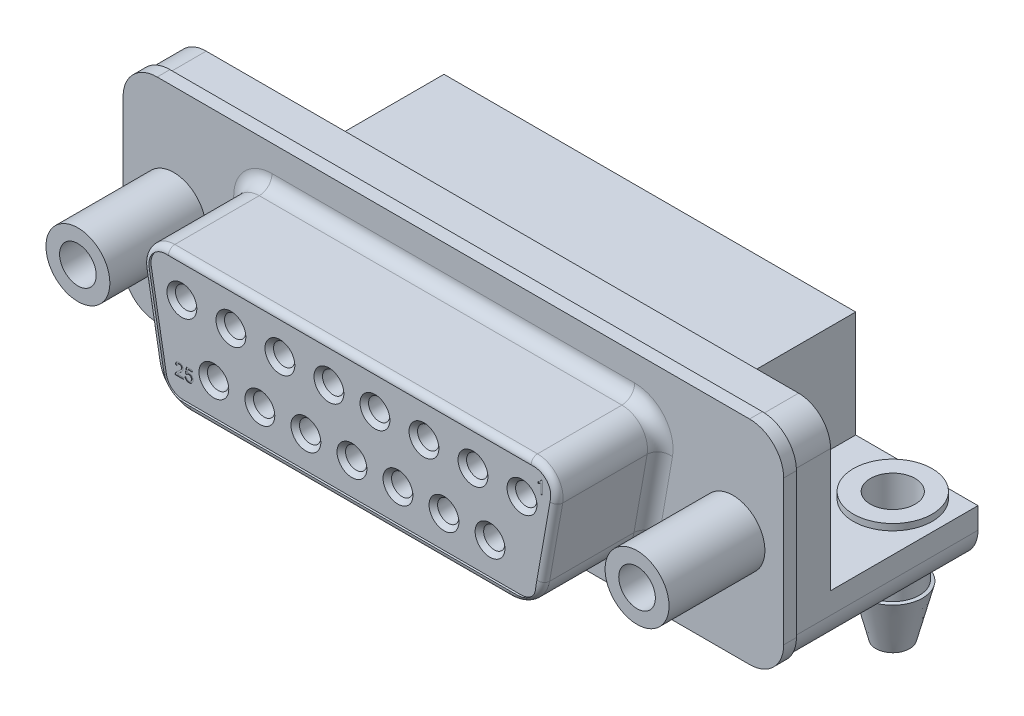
from build123d import *

# Parameters (mm, degrees)
SKETCH1_R               = 1.0922
BASE_EXTRUDE_DEPTH      = 0.762
PIN_BOSS_DEPTH          = 6.1722
FILLET1_R               = 0.762
FILLET2_R               = 0.381
PIN_FACE_RELEIF_DEPTH   = 0.127
BACKSIDE_BOSS_DEPTH     = 2.159
BACKSIDE_2_DEPTH        = 8.7884
SKETCH10_R              = 0.635
BOTT_ROW_HOLES_DEPTH    = 6.35
SKETCH11_R              = 0.635
TOP_ROW_HOLES_DEPTH     = 6.35
CHAMFER2_SIZE           = 0.254
SKETCH13_W              = 0.635
SKETCH13_H              = 0.635
PINS_PINS_PINS_DEPTH    = 4.2418
SKETCH15_R              = 1.905
SKETCH15_R_2            = 1.0922
THREADEDSTANDOFFS_DEPTH = 5.715
SKETCH16_R              = 1.5875
MOUNT_HOLES_DEPTH       = 25.396524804
F_1_PIN_DEPTH           = 0.0254
F_15PIN_DEPTH           = 0.0254


with BuildPart() as part:
    # Sketch1 → Base-Extrude (new body)
    with BuildSketch(Plane.XY):
        with BuildLine():
            Line((-17.653, -6.3373), (17.653, -6.3373))
            ThreePointArc((17.653, -6.3373), (19.089840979, -5.742140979), (19.685, -4.3053))
            Line((19.685, -4.3053), (19.685, 4.3053))
            ThreePointArc((19.685, 4.3053), (19.089840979, 5.742140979), (17.653, 6.3373))
            Line((17.653, 6.3373), (-17.653, 6.3373))
            ThreePointArc((-17.653, 6.3373), (-19.089840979, 5.742140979), (-19.685, 4.3053))
            Line((-19.685, 4.3053), (-19.685, -4.3053))
            ThreePointArc((-19.685, -4.3053), (-19.089840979, -5.742140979), (-17.653, -6.3373))
        make_face()
        with Locations(Location((16.6624, 0, 0), (0, 0, 180))):
            Circle(SKETCH1_R, mode=Mode.SUBTRACT)
        with Locations(Location((-16.6624, 0, 0), (0, 0, 180))):
            Circle(SKETCH1_R, mode=Mode.SUBTRACT)
    extrude(amount=BASE_EXTRUDE_DEPTH)

    # Sketch2 → Pin Boss (add)
    with BuildSketch(Plane.XY.offset(0.762)):
        with BuildLine():
            Line((-10.8077, 4.0132), (10.8077, 4.0132))
            ThreePointArc((10.8077, 4.0132), (11.975151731, 3.468808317), (12.308547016, 2.224560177))
            Line((12.308547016, 2.224560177), (11.527134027, -2.207053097))
            ThreePointArc((11.527134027, -2.207053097), (10.832149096, -3.410802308), (9.526004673, -3.8862))
            Line((9.526004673, -3.8862), (-9.526004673, -3.8862))
            ThreePointArc((-9.526004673, -3.8862), (-10.832149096, -3.410802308), (-11.527134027, -2.207053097))
            Line((-11.527134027, -2.207053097), (-12.308547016, 2.224560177))
            ThreePointArc((-12.308547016, 2.224560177), (-11.975151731, 3.468808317), (-10.8077, 4.0132))
        make_face()
    extrude(amount=PIN_BOSS_DEPTH)

    # Fillet1
    fillet1_edges = [part.edges().sort_by_distance(p)[0] for p in [
        (11.975151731, 3.468808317, 0.762),
        (0, 4.0132, 0.762),
        (-11.975151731, 3.468808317, 0.762),
        (-11.917840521, 0.00875354, 0.762),
        (-10.832149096, -3.410802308, 0.762),
        (0, -3.8862, 0.762),
        (10.832149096, -3.410802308, 0.762),
        (11.917840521, 0.00875354, 0.762),
    ]]
    fillet(fillet1_edges, radius=FILLET1_R)

    # Fillet2
    fillet2_edges = [part.edges().sort_by_distance(p)[0] for p in [
        (11.975151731, 3.468808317, 6.9342),
        (0, 4.0132, 6.9342),
        (-11.975151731, 3.468808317, 6.9342),
        (-11.917840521, 0.00875354, 6.9342),
        (-10.832149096, -3.410802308, 6.9342),
        (0, -3.8862, 6.9342),
        (10.832149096, -3.410802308, 6.9342),
        (11.917840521, 0.00875354, 6.9342),
    ]]
    fillet(fillet2_edges, radius=FILLET2_R)

    # Sketch3 → Pin Face Releif (cut)
    with BuildSketch(Plane.XY.offset(6.9342)):
        with BuildLine():
            Line((-10.959052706, 3.6322), (10.959052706, 3.6322))
            ThreePointArc((10.959052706, 3.6322), (11.73735386, 3.269272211), (11.959617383, 2.439773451))
            Line((11.959617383, 2.439773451), (11.059397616, -2.665626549))
            ThreePointArc((11.059397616, -2.665626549), (10.71190515, -3.267501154), (10.058832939, -3.5052))
            Line((10.058832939, -3.5052), (-10.058832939, -3.5052))
            ThreePointArc((-10.058832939, -3.5052), (-10.71190515, -3.267501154), (-11.059397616, -2.665626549))
            Line((-11.059397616, -2.665626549), (-11.959617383, 2.439773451))
            ThreePointArc((-11.959617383, 2.439773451), (-11.73735386, 3.269272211), (-10.959052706, 3.6322))
        make_face()
    extrude(amount=-PIN_FACE_RELEIF_DEPTH, mode=Mode.SUBTRACT)

    # Sketch5 → BACKSIDE BOSS (add)
    with BuildSketch(Plane(origin=(0, 0, 0), x_dir=(-1, 0, 0), z_dir=(0, 0, -1))):
        with BuildLine():
            Line((19.558, -4.3053), (19.558, 4.3053))
            ThreePointArc((19.558, 4.3053), (19.000038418, 5.652338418), (17.653, 6.2103))
            Line((17.653, 6.2103), (-17.653, 6.2103))
            ThreePointArc((-17.653, 6.2103), (-19.000038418, 5.652338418), (-19.558, 4.3053))
            Line((-19.558, 4.3053), (-19.558, -4.3053))
            ThreePointArc((-19.558, -4.3053), (-19.000038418, -5.652338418), (-17.653, -6.2103))
            Line((-17.653, -6.2103), (17.653, -6.2103))
            ThreePointArc((17.653, -6.2103), (19.000038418, -5.652338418), (19.558, -4.3053))
        make_face()
    extrude(amount=BACKSIDE_BOSS_DEPTH)

    # Sketch7 → backside_2 (add)
    with BuildSketch(Plane(origin=(0, 0, -2.159), x_dir=(-1, 0, 0), z_dir=(0, 0, -1))):
        with BuildLine():
            Line((17.653, -6.2103), (-17.653, -6.2103))
            ThreePointArc((-17.653, -6.2103), (-19.000038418, -5.652338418), (-19.558, -4.3053))
            Line((-19.558, -4.3053), (-19.558, -3.0353))
            Line((-19.558, -3.0353), (-12.2682, -3.0353))
            Line((-12.2682, -3.0353), (-12.2682, 3.3147))
            Line((-12.2682, 3.3147), (12.2682, 3.3147))
            Line((12.2682, 3.3147), (12.2682, -3.0353))
            Line((12.2682, -3.0353), (19.558, -3.0353))
            Line((19.558, -3.0353), (19.558, -4.3053))
            ThreePointArc((19.558, -4.3053), (19.000038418, -5.652338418), (17.653, -6.2103))
        make_face()
    extrude(amount=BACKSIDE_2_DEPTH)

    # Sketch10 → bott ROW HOLES (cut)
    with BuildSketch(Plane.XY.offset(6.8072)):
        with Locations((0, -1.6002)):
            Circle(SKETCH10_R)
        with Locations((2.7432, -1.6002)):
            Circle(SKETCH10_R)
        with Locations((5.4864, -1.6002)):
            Circle(SKETCH10_R)
        with Locations((8.2296, -1.6002)):
            Circle(SKETCH10_R)
        with Locations(Location((-8.2296, -1.6002, 0), (0, 0, 180))):
            Circle(SKETCH10_R)
        with Locations(Location((-5.4864, -1.6002, 0), (0, 0, 180))):
            Circle(SKETCH10_R)
        with Locations(Location((-2.7432, -1.6002, 0), (0, 0, 180))):
            Circle(SKETCH10_R)
    extrude(amount=-BOTT_ROW_HOLES_DEPTH, mode=Mode.SUBTRACT)

    # Sketch11 → top ROW HOLES (cut)
    with BuildSketch(Plane.XY.offset(6.8072)):
        with Locations((-4.2926, 1.6002)):
            Circle(SKETCH11_R)
        with Locations((-7.2136, 1.6002)):
            Circle(SKETCH11_R)
        with Locations((-10.1346, 1.6002)):
            Circle(SKETCH11_R)
        with Locations(Location((1.3716, 1.6002, 0), (0, 0, 180))):
            Circle(SKETCH11_R)
        with Locations((-1.3716, 1.6002)):
            Circle(SKETCH11_R)
        with Locations(Location((10.1346, 1.6002, 0), (0, 0, 180))):
            Circle(SKETCH11_R)
        with Locations(Location((7.2136, 1.6002, 0), (0, 0, 180))):
            Circle(SKETCH11_R)
        with Locations(Location((4.2926, 1.6002, 0), (0, 0, 180))):
            Circle(SKETCH11_R)
    extrude(amount=-TOP_ROW_HOLES_DEPTH, mode=Mode.SUBTRACT)

    # Chamfer2
    chamfer2_edges = [part.edges().sort_by_distance(p)[0] for p in [
        (-0.635, -1.6002, 6.8072),
        (2.1082, -1.6002, 6.8072),
        (4.8514, -1.6002, 6.8072),
        (7.5946, -1.6002, 6.8072),
        (-7.5946, -1.6002, 6.8072),
        (-4.8514, -1.6002, 6.8072),
        (-2.1082, -1.6002, 6.8072),
        (-4.9276, 1.6002, 6.8072),
        (-7.8486, 1.6002, 6.8072),
        (-10.7696, 1.6002, 6.8072),
        (2.0066, 1.6002, 6.8072),
        (-2.0066, 1.6002, 6.8072),
        (10.7696, 1.6002, 6.8072),
        (7.8486, 1.6002, 6.8072),
        (4.9276, 1.6002, 6.8072),
    ]]
    chamfer(chamfer2_edges, length=CHAMFER2_SIZE)

    # Sketch13 → pins pins pins (add)
    with BuildSketch(Plane.XZ.offset(6.2103)):
        with Locations((-8.132710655, -8.665222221)):
            Rectangle(SKETCH13_W, SKETCH13_H)
        with Locations((-5.414910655, -8.665222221)):
            Rectangle(SKETCH13_W, SKETCH13_H)
        with Locations((-2.697110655, -8.665222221)):
            Rectangle(SKETCH13_W, SKETCH13_H)
        with Locations((0.020689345, -8.665222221)):
            Rectangle(SKETCH13_W, SKETCH13_H)
        with Locations((2.738489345, -8.665222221)):
            Rectangle(SKETCH13_W, SKETCH13_H)
        with Locations((5.456289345, -8.665222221)):
            Rectangle(SKETCH13_W, SKETCH13_H)
        with Locations((8.174089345, -8.665222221)):
            Rectangle(SKETCH13_W, SKETCH13_H)
        with Locations((-9.490929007, -10.324150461)):
            Rectangle(SKETCH13_W, SKETCH13_H)
        with Locations((-6.773129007, -10.324150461)):
            Rectangle(SKETCH13_W, SKETCH13_H)
        with Locations((-4.055329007, -10.324150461)):
            Rectangle(SKETCH13_W, SKETCH13_H)
        with Locations((-1.337529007, -10.324150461)):
            Rectangle(SKETCH13_W, SKETCH13_H)
        with Locations((1.380270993, -10.324150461)):
            Rectangle(SKETCH13_W, SKETCH13_H)
        with Locations((4.098070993, -10.324150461)):
            Rectangle(SKETCH13_W, SKETCH13_H)
        with Locations((6.815870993, -10.324150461)):
            Rectangle(SKETCH13_W, SKETCH13_H)
        with Locations((9.533670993, -10.324150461)):
            Rectangle(SKETCH13_W, SKETCH13_H)
    extrude(amount=PINS_PINS_PINS_DEPTH)

    # Sketch15 → Threadedstandoffs (add)
    # profile 1 of 2: a face of its own
    with BuildSketch(Plane.XY.offset(0.762)):
        with Locations((16.6624, 0)):
            Circle(SKETCH15_R)
        with Locations(Location((16.6624, 0, 0), (0, 0, 180))):
            Circle(SKETCH15_R_2, mode=Mode.SUBTRACT)
    # profile 2 of 2: a face of its own
    with BuildSketch(Plane.XY.offset(0.762)):
        with Locations((-16.6624, 0)):
            Circle(SKETCH15_R)
        with Locations(Location((-16.6624, 0, 0), (0, 0, 180))):
            Circle(SKETCH15_R_2, mode=Mode.SUBTRACT)
    extrude(amount=THREADEDSTANDOFFS_DEPTH)

    # Sketch16 → mount holes (cut, through all)
    with BuildSketch(Plane(origin=(0, -3.0353, 0), x_dir=(-1, 0, 0), z_dir=(0, 1, 0))):
        with Locations((-16.6624, -8.763)):
            Circle(SKETCH16_R)
        with Locations(Location((16.6624, -8.763, 0), (0, 0, 51.391172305))):
            Circle(SKETCH16_R)
    extrude(amount=-MOUNT_HOLES_DEPTH, mode=Mode.SUBTRACT)

    # Sketch17 → SNAP IN PEG (revolve)
    with BuildSketch(Plane(origin=(0, 0, -8.763), x_dir=(-1, 0, 0), z_dir=(0, 0, -1)), mode=Mode.PRIVATE) as snap_in_peg_sk:
        Polygon((-14.3129, -3.0353), (-14.3129, -2.6543), (-15.3289, -2.6543), (-15.3289, -7.423326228), (-15.193584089, -7.458066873), (-15.9004, -10.211137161), (-15.654378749, -10.2743), (-14.8844, -7.275208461), (-15.0749, -7.2263), (-15.0749, -3.0353), align=None)
    snap_in_peg = revolve(snap_in_peg_sk.sketch.rotate(Axis((16.6624, -6.90433229, -8.763), (0, 1, 0)), 270), axis=Axis((16.6624, -6.90433229, -8.763), (0, 1, 0)))

    # Mirror1: SNAP IN PEG across plane
    add(snap_in_peg.mirror(Plane(origin=(0, 0, 0), x_dir=(0, 0, 1), z_dir=(1, 0, 0))))

    # Sketch18 → 1 pin (cut)
    with BuildSketch(Plane.XY.offset(6.8072)):
        with BuildLine():
            Line((11.351991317, 2.269323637), (11.254573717, 2.269323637))
            Line((11.254573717, 2.269323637), (11.254573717, 2.861439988))
            add(Edge.make_bspline(
                [(11.254573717, 2.861439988), (11.248964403, 2.856030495), (11.237306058, 2.844787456), (11.217598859, 2.828875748), (11.195603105, 2.812748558), (11.171604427, 2.797240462), (11.147141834, 2.782641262), (11.123501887, 2.769511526), (11.101079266, 2.758400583), (11.086309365, 2.752325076), (11.079222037, 2.749409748)],
                knots=[0, 0, 0, 0, 0.893362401, 1.856755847, 2.901947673, 4.020460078, 5.132200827, 6.168787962, 7.121294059, 8, 8, 8, 8], degree=3))
            Line((11.079222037, 2.749409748), (11.079222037, 2.839216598))
            add(Edge.make_bspline(
                [(11.079222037, 2.839216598), (11.091395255, 2.84548583), (11.115387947, 2.857842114), (11.149284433, 2.879183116), (11.18093045, 2.902317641), (11.209802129, 2.927240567), (11.235683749, 2.95271627), (11.257494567, 2.978422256), (11.275744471, 3.003416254), (11.284900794, 3.020846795), (11.289278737, 3.029180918)],
                knots=[0, 0, 0, 0, 1.141258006, 2.249351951, 3.335817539, 4.406819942, 5.426913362, 6.360259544, 7.215985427, 8, 8, 8, 8], degree=3))
            Line((11.289278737, 3.029180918), (11.351991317, 3.029180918))
            Line((11.351991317, 3.029180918), (11.351991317, 2.269323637))
        make_face()
    extrude(amount=-F_1_PIN_DEPTH, mode=Mode.SUBTRACT)

    # Sketch19 → 15PIN (cut)
    with BuildSketch(Plane.XY.offset(6.8072)):
        with BuildLine():
            Line((-10.051378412, -2.349835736), (-10.051378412, -2.44493857))
            Line((-10.051378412, -2.44493857), (-10.536402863, -2.44493857))
            add(Edge.make_bspline(
                [(-10.536402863, -2.44493857), (-10.536412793, -2.439286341), (-10.536432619, -2.428000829), (-10.534522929, -2.411310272), (-10.531531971, -2.394841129), (-10.528150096, -2.384280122), (-10.526446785, -2.378960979)],
                knots=[0, 0, 0, 0, 1.01057331, 2.01775941, 3.001627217, 4, 4, 4, 4], degree=3))
            add(Edge.make_bspline(
                [(-10.526446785, -2.378960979), (-10.523299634, -2.370270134), (-10.516891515, -2.352574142), (-10.503908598, -2.327041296), (-10.488637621, -2.301662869), (-10.473769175, -2.281001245), (-10.460152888, -2.264494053), (-10.448733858, -2.251579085), (-10.436079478, -2.238359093), (-10.422199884, -2.224836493), (-10.407228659, -2.210923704), (-10.391145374, -2.196574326), (-10.37376011, -2.182055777), (-10.361623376, -2.172432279), (-10.355410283, -2.167505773)],
                knots=[0, 0, 0, 0, 1.204657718, 2.452881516, 3.728232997, 5.065887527, 5.768225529, 6.518857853, 7.313994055, 8.154655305, 9.046094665, 9.979688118, 10.965752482, 12, 12, 12, 12], degree=3))
            add(Edge.make_bspline(
                [(-10.355410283, -2.167505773), (-10.345865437, -2.15947203), (-10.32748623, -2.14400255), (-10.30153191, -2.121047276), (-10.277826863, -2.099732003), (-10.256748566, -2.079683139), (-10.23812462, -2.061095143), (-10.221911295, -2.044010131), (-10.207969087, -2.02848142), (-10.196468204, -2.013946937), (-10.186764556, -2.000222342), (-10.178541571, -1.986834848), (-10.171688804, -1.973550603), (-10.165981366, -1.960411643), (-10.161467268, -1.94736178), (-10.158390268, -1.934362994), (-10.156303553, -1.921544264), (-10.156094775, -1.913014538), (-10.155991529, -1.908796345)],
                knots=[0, 0, 0, 0, 1.782554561, 3.432421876, 4.950675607, 6.337395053, 7.588547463, 8.709982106, 9.702713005, 10.569305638, 11.356701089, 12.103210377, 12.812277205, 13.490692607, 14.148717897, 14.782152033, 15.397739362, 16, 16, 16, 16], degree=3))
            add(Edge.make_bspline(
                [(-10.155991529, -1.908796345), (-10.156094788, -1.904627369), (-10.156297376, -1.896448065), (-10.158219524, -1.884477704), (-10.160895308, -1.87294996), (-10.165221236, -1.862072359), (-10.170370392, -1.851522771), (-10.176975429, -1.841634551), (-10.184616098, -1.832161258), (-10.193364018, -1.82335266), (-10.202918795, -1.815088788), (-10.213594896, -1.808219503), (-10.224691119, -1.802035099), (-10.236590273, -1.797062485), (-10.249273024, -1.793411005), (-10.262647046, -1.790760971), (-10.276710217, -1.789080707), (-10.286307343, -1.788848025), (-10.29121587, -1.788729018)],
                knots=[0, 0, 0, 0, 0.988194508, 1.938783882, 2.870742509, 3.789494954, 4.709148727, 5.651055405, 6.603531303, 7.592354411, 8.592907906, 9.593461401, 10.59787167, 11.603930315, 12.645063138, 13.723588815, 14.835711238, 16, 16, 16, 16], degree=3))
            add(Edge.make_bspline(
                [(-10.29121587, -1.788729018), (-10.296372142, -1.788847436), (-10.306463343, -1.789079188), (-10.321213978, -1.790766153), (-10.335217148, -1.793343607), (-10.348439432, -1.797284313), (-10.360864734, -1.802248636), (-10.372442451, -1.808497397), (-10.383357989, -1.815551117), (-10.393267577, -1.82390219), (-10.402228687, -1.833161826), (-10.410184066, -1.843242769), (-10.416702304, -1.854339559), (-10.422085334, -1.866208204), (-10.426413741, -1.878886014), (-10.429556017, -1.892469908), (-10.431269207, -1.906920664), (-10.431613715, -1.916816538), (-10.431789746, -1.921872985)],
                knots=[0, 0, 0, 0, 1.131143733, 2.213731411, 3.253917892, 4.251203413, 5.236093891, 6.184197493, 7.13373276, 8.082770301, 9.020476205, 9.957489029, 10.893177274, 11.836722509, 12.812818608, 13.827831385, 14.890097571, 16, 16, 16, 16], degree=3))
            Line((-10.431789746, -1.921872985), (-10.52689258, -1.912362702))
            add(Edge.make_bspline(
                [(-10.52689258, -1.912362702), (-10.525919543, -1.904074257), (-10.524026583, -1.887949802), (-10.519311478, -1.864596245), (-10.512691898, -1.842870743), (-10.504771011, -1.822470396), (-10.494841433, -1.80374248), (-10.4836169, -1.786299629), (-10.470378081, -1.770695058), (-10.455752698, -1.756436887), (-10.439580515, -1.743871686), (-10.422013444, -1.732894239), (-10.40305952, -1.723712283), (-10.382824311, -1.716110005), (-10.361261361, -1.710341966), (-10.338401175, -1.706205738), (-10.31420699, -1.70365612), (-10.297611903, -1.703312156), (-10.289135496, -1.703136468)],
                knots=[0, 0, 0, 0, 1.130804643, 2.199883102, 3.223565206, 4.205909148, 5.160801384, 6.091796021, 7.01151579, 7.927798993, 8.855738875, 9.7815393, 10.730299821, 11.705391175, 12.706931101, 13.751121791, 14.851322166, 16, 16, 16, 16], degree=3))
            add(Edge.make_bspline(
                [(-10.289135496, -1.703136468), (-10.280557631, -1.703283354), (-10.263847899, -1.703569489), (-10.239499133, -1.706497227), (-10.2165254, -1.711057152), (-10.194842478, -1.717412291), (-10.174578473, -1.725745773), (-10.155717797, -1.735927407), (-10.138173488, -1.747857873), (-10.122238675, -1.76168039), (-10.107869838, -1.776769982), (-10.09527767, -1.792873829), (-10.084750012, -1.809923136), (-10.075786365, -1.827685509), (-10.069137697, -1.846536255), (-10.064462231, -1.866219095), (-10.061285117, -1.886750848), (-10.061022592, -1.90075971), (-10.060888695, -1.907904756)],
                knots=[0, 0, 0, 0, 1.195390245, 2.328627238, 3.413424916, 4.457841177, 5.473507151, 6.462241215, 7.441013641, 8.425227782, 9.397253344, 10.342087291, 11.269524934, 12.186751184, 13.110685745, 14.048630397, 15.004728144, 16, 16, 16, 16], degree=3))
            add(Edge.make_bspline(
                [(-10.060888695, -1.907904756), (-10.061093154, -1.915245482), (-10.061502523, -1.929943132), (-10.064697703, -1.951911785), (-10.070164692, -1.97364203), (-10.07741246, -1.995398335), (-10.087314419, -2.017267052), (-10.099823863, -2.03954986), (-10.115343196, -2.062329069), (-10.130268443, -2.081693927), (-10.144161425, -2.097926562), (-10.156476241, -2.111286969), (-10.17072377, -2.125481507), (-10.186369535, -2.141001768), (-10.204051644, -2.157296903), (-10.22326205, -2.174854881), (-10.244421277, -2.193213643), (-10.259109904, -2.205755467), (-10.266697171, -2.212233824)],
                knots=[0, 0, 0, 0, 0.927118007, 1.856282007, 2.79721255, 3.754929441, 4.749232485, 5.824981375, 6.979078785, 8.228161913, 8.911614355, 9.677694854, 10.522803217, 11.452009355, 12.461436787, 13.560019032, 14.739651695, 16, 16, 16, 16], degree=3))
            add(Edge.make_bspline(
                [(-10.266697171, -2.212233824), (-10.273194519, -2.217523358), (-10.285583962, -2.227609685), (-10.303210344, -2.242232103), (-10.318998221, -2.255640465), (-10.333316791, -2.267397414), (-10.345644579, -2.27807162), (-10.356415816, -2.287195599), (-10.365239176, -2.295228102), (-10.378675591, -2.307429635), (-10.395693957, -2.324821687), (-10.408233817, -2.341721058), (-10.414255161, -2.349835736)],
                knots=[0, 0, 0, 0, 1.241996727, 2.368296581, 3.394949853, 4.3125351, 5.114548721, 5.812230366, 6.404953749, 6.883082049, 8.503329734, 10, 10, 10, 10], degree=3))
            Line((-10.414255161, -2.349835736), (-10.051378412, -2.349835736))
        make_face()
        with BuildLine():
            Line((-9.946765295, -2.245222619), (-9.851662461, -2.235712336))
            add(Edge.make_bspline(
                [(-9.851662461, -2.235712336), (-9.850720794, -2.241070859), (-9.848889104, -2.251494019), (-9.845398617, -2.266581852), (-9.840865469, -2.280598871), (-9.835771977, -2.293666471), (-9.829717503, -2.305646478), (-9.82315743, -2.316728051), (-9.815421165, -2.326517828), (-9.807287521, -2.335527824), (-9.798360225, -2.343467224), (-9.788553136, -2.350160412), (-9.778139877, -2.355999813), (-9.76699362, -2.360780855), (-9.75509728, -2.364280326), (-9.742602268, -2.367047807), (-9.729347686, -2.368442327), (-9.720304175, -2.368716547), (-9.715695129, -2.368856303)],
                knots=[0, 0, 0, 0, 1.237781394, 2.407677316, 3.51963579, 4.58689595, 5.594855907, 6.570874, 7.510833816, 8.428091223, 9.330271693, 10.221190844, 11.124215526, 12.043132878, 12.973586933, 13.941700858, 14.950982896, 16, 16, 16, 16], degree=3))
            add(Edge.make_bspline(
                [(-9.715695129, -2.368856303), (-9.710040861, -2.36871968), (-9.698983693, -2.368452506), (-9.682897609, -2.366192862), (-9.667703, -2.362466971), (-9.653472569, -2.357252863), (-9.640039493, -2.350768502), (-9.627849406, -2.342372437), (-9.616237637, -2.332934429), (-9.605951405, -2.321682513), (-9.596588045, -2.309432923), (-9.588506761, -2.296061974), (-9.581703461, -2.281757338), (-9.575975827, -2.266521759), (-9.571746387, -2.250268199), (-9.568635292, -2.233083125), (-9.566638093, -2.214955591), (-9.566450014, -2.202530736), (-9.56635396, -2.196185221)],
                knots=[0, 0, 0, 0, 1.052816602, 2.058828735, 3.018813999, 3.961574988, 4.877590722, 5.788574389, 6.712363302, 7.658909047, 8.620312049, 9.580784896, 10.562948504, 11.56722449, 12.607883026, 13.686460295, 14.818448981, 16, 16, 16, 16], degree=3))
            add(Edge.make_bspline(
                [(-9.56635396, -2.196185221), (-9.566463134, -2.190138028), (-9.56667572, -2.178362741), (-9.568466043, -2.161215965), (-9.571486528, -2.145092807), (-9.575394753, -2.129815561), (-9.580781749, -2.115622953), (-9.587171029, -2.102309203), (-9.594998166, -2.09015687), (-9.603706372, -2.078787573), (-9.613652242, -2.068595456), (-9.624970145, -2.059989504), (-9.637216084, -2.052457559), (-9.650636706, -2.046349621), (-9.665239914, -2.041811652), (-9.680880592, -2.038320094), (-9.697721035, -2.036483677), (-9.709301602, -2.036161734), (-9.715249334, -2.035996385)],
                knots=[0, 0, 0, 0, 1.165854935, 2.270189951, 3.319242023, 4.32700288, 5.306253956, 6.24172124, 7.169108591, 8.088047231, 8.999810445, 9.905349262, 10.822648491, 11.767237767, 12.739852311, 13.766490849, 14.852878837, 16, 16, 16, 16], degree=3))
            add(Edge.make_bspline(
                [(-9.715249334, -2.035996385), (-9.72264505, -2.036212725), (-9.73682836, -2.036627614), (-9.757208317, -2.040117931), (-9.775760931, -2.045756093), (-9.792276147, -2.054159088), (-9.807031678, -2.064197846), (-9.820334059, -2.075557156), (-9.832292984, -2.088229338), (-9.838852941, -2.09777002), (-9.842152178, -2.102568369)],
                knots=[0, 0, 0, 0, 1.182877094, 2.268490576, 3.298955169, 4.273890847, 5.221533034, 6.149304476, 7.069219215, 8, 8, 8, 8], degree=3))
            Line((-9.842152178, -2.102568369), (-9.937255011, -2.093058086))
            Line((-9.937255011, -2.093058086), (-9.861172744, -1.712646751))
            Line((-9.861172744, -1.712646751), (-9.50929226, -1.712646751))
            Line((-9.50929226, -1.712646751), (-9.50929226, -1.807749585))
            Line((-9.50929226, -1.807749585), (-9.783455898, -1.807749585))
            Line((-9.783455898, -1.807749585), (-9.821199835, -1.999887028))
            add(Edge.make_bspline(
                [(-9.821199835, -1.999887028), (-9.815952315, -1.995949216), (-9.805647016, -1.988215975), (-9.789572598, -1.978090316), (-9.773268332, -1.969555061), (-9.75682913, -1.962565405), (-9.740124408, -1.957120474), (-9.723254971, -1.953337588), (-9.70616338, -1.950780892), (-9.694702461, -1.950529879), (-9.688947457, -1.950403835)],
                knots=[0, 0, 0, 0, 1.093835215, 2.148119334, 3.164235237, 4.159999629, 5.123971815, 6.089888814, 7.040853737, 8, 8, 8, 8], degree=3))
            add(Edge.make_bspline(
                [(-9.688947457, -1.950403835), (-9.681457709, -1.950600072), (-9.666708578, -1.950986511), (-9.644975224, -1.954161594), (-9.624194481, -1.959551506), (-9.604203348, -1.966810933), (-9.58526543, -1.976434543), (-9.567188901, -1.988086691), (-9.550046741, -2.001863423), (-9.533935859, -2.0175048), (-9.519322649, -2.034868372), (-9.506243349, -2.053387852), (-9.495560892, -2.073433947), (-9.486576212, -2.094483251), (-9.479799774, -2.116881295), (-9.47465622, -2.140310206), (-9.471906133, -2.165062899), (-9.471472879, -2.181913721), (-9.471251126, -2.19053849)],
                knots=[0, 0, 0, 0, 0.991958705, 1.953407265, 2.902004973, 3.832128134, 4.765371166, 5.71007953, 6.676509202, 7.674246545, 8.68000108, 9.679398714, 10.671856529, 11.683459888, 12.706765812, 13.76733029, 14.85725088, 16, 16, 16, 16], degree=3))
            add(Edge.make_bspline(
                [(-9.471251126, -2.19053849), (-9.471419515, -2.198767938), (-9.471752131, -2.215023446), (-9.474477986, -2.238978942), (-9.478968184, -2.262061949), (-9.48497932, -2.284340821), (-9.493101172, -2.305689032), (-9.502952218, -2.326175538), (-9.514315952, -2.34601411), (-9.523429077, -2.358243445), (-9.52801563, -2.364398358)],
                knots=[0, 0, 0, 0, 1.059692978, 2.093196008, 3.100373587, 4.086253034, 5.061402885, 6.037282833, 7.012182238, 8, 8, 8, 8], degree=3))
            add(Edge.make_bspline(
                [(-9.52801563, -2.364398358), (-9.533842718, -2.371583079), (-9.545305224, -2.385716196), (-9.565152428, -2.404060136), (-9.586488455, -2.419649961), (-9.609440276, -2.432315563), (-9.633853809, -2.442493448), (-9.660028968, -2.449266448), (-9.687649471, -2.453814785), (-9.706611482, -2.454234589), (-9.716289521, -2.454448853)],
                knots=[0, 0, 0, 0, 1.023140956, 2.012628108, 2.982342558, 3.942221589, 4.908720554, 5.902469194, 6.929439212, 8, 8, 8, 8], degree=3))
            add(Edge.make_bspline(
                [(-9.716289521, -2.454448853), (-9.724272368, -2.454286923), (-9.739888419, -2.453970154), (-9.762753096, -2.451216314), (-9.784500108, -2.44682491), (-9.805136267, -2.440526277), (-9.824723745, -2.432567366), (-9.843034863, -2.422456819), (-9.86038739, -2.410890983), (-9.876399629, -2.397513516), (-9.890988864, -2.382592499), (-9.904061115, -2.366444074), (-9.915439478, -2.349057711), (-9.925118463, -2.330537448), (-9.933185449, -2.310901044), (-9.939357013, -2.290014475), (-9.944245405, -2.26808267), (-9.945916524, -2.252922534), (-9.946765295, -2.245222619)],
                knots=[0, 0, 0, 0, 1.108768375, 2.168973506, 3.19473529, 4.187459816, 5.162590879, 6.12651078, 7.088512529, 8.056012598, 9.019588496, 9.983680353, 10.938070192, 11.90157236, 12.88306954, 13.882379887, 14.924449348, 16, 16, 16, 16], degree=3))
        make_face()
    extrude(amount=-F_15PIN_DEPTH, mode=Mode.SUBTRACT)


solid = part.part
